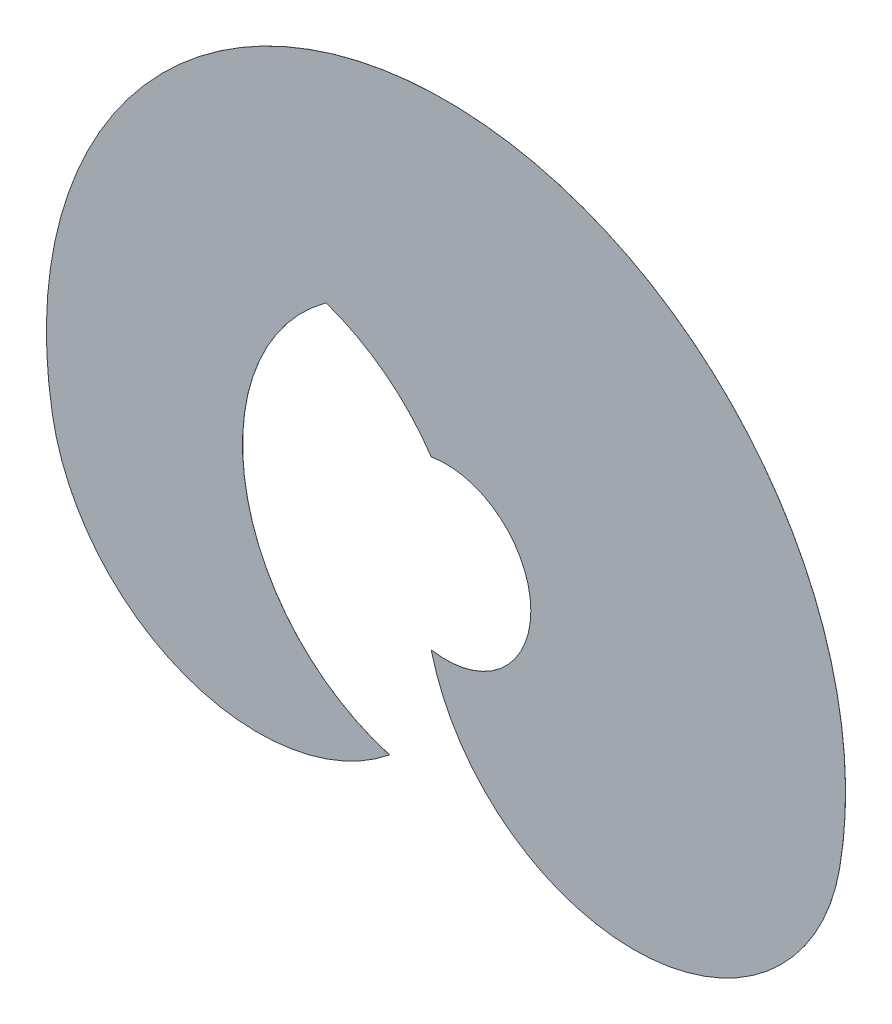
ISO-10303-21;
HEADER;
FILE_DESCRIPTION(('STEP AP214'),'2;1');
FILE_NAME('part.step','',(''),(''),'','','');
FILE_SCHEMA(('AUTOMOTIVE_DESIGN { 1 0 10303 214 1 1 1 1 }'));
ENDSEC;
DATA;
#1=APPLICATION_CONTEXT('core data for automotive mechanical design processes');
#2=APPLICATION_PROTOCOL_DEFINITION('international standard','automotive_design',2000,#1);
#3=PRODUCT_CONTEXT('',#1,'mechanical');
#4=PRODUCT('Part','Part','',(#3));
#5=PRODUCT_RELATED_PRODUCT_CATEGORY('part','',(#4));
#6=PRODUCT_DEFINITION_FORMATION('','',#4);
#7=PRODUCT_DEFINITION_CONTEXT('part definition',#1,'design');
#8=PRODUCT_DEFINITION('design','',#6,#7);
#9=PRODUCT_DEFINITION_SHAPE('','',#8);
#10=(LENGTH_UNIT() NAMED_UNIT(*) SI_UNIT(.MILLI.,.METRE.));
#11=(NAMED_UNIT(*) PLANE_ANGLE_UNIT() SI_UNIT($,.RADIAN.));
#12=(NAMED_UNIT(*) SI_UNIT($,.STERADIAN.) SOLID_ANGLE_UNIT());
#13=UNCERTAINTY_MEASURE_WITH_UNIT(LENGTH_MEASURE(1.E-05),#10,'distance_accuracy_value','');
#14=(GEOMETRIC_REPRESENTATION_CONTEXT(3) GLOBAL_UNCERTAINTY_ASSIGNED_CONTEXT((#13)) GLOBAL_UNIT_ASSIGNED_CONTEXT((#10,
#11,#12)) REPRESENTATION_CONTEXT('',''));
#15=CARTESIAN_POINT('',(0.,0.,0.));
#16=DIRECTION('',(0.,0.,1.));
#17=DIRECTION('',(1.,0.,0.));
#18=AXIS2_PLACEMENT_3D('',#15,#16,#17);
#19=CARTESIAN_POINT('',(250.,607.,0.5));
#20=DIRECTION('',(0.,0.,-1.));
#21=DIRECTION('',(-1.,0.,0.));
#22=AXIS2_PLACEMENT_3D('',#19,#20,#21);
#23=CYLINDRICAL_SURFACE('',#22,1247.77202533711);
#24=CARTESIAN_POINT('',(250.,607.,0.));
#25=DIRECTION('',(0.,0.,-1.));
#26=DIRECTION('',(1.,0.,0.));
#27=AXIS2_PLACEMENT_3D('',#24,#25,#26);
#28=CIRCLE('',#27,1247.77202533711);
#29=CARTESIAN_POINT('',(-96.5199902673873,-591.690503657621,0.));
#30=VERTEX_POINT('',#29);
#31=CARTESIAN_POINT('',(-485.598575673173,1614.88380415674,0.));
#32=VERTEX_POINT('',#31);
#33=EDGE_CURVE('E116',#30,#32,#28,.T.);
#34=ORIENTED_EDGE('',*,*,#33,.T.);
#35=DIRECTION('',(0.,0.,-1.));
#36=VECTOR('',#35,1.);
#37=CARTESIAN_POINT('',(-485.598575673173,1614.88380415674,0.5));
#38=LINE('',#37,#36);
#39=CARTESIAN_POINT('',(-485.598575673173,1614.88380415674,0.5));
#40=VERTEX_POINT('',#39);
#41=EDGE_CURVE('E11',#40,#32,#38,.T.);
#42=ORIENTED_EDGE('',*,*,#41,.F.);
#43=CARTESIAN_POINT('',(250.,607.,0.5));
#44=DIRECTION('',(0.,0.,-1.));
#45=DIRECTION('',(1.,0.,0.));
#46=AXIS2_PLACEMENT_3D('',#43,#44,#45);
#47=CIRCLE('',#46,1247.77202533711);
#48=CARTESIAN_POINT('',(-96.5199902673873,-591.690503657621,0.5));
#49=VERTEX_POINT('',#48);
#50=EDGE_CURVE('E126',#49,#40,#47,.T.);
#51=ORIENTED_EDGE('',*,*,#50,.F.);
#52=DIRECTION('',(0.,0.,-1.));
#53=VECTOR('',#52,1.);
#54=CARTESIAN_POINT('',(-96.5199902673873,-591.690503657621,0.5));
#55=LINE('',#54,#53);
#56=EDGE_CURVE('E112',#49,#30,#55,.T.);
#57=ORIENTED_EDGE('',*,*,#56,.T.);
#58=EDGE_LOOP('',(#34,#42,#51,#57));
#59=FACE_BOUND('',#58,.T.);
#60=ADVANCED_FACE('F32',(#59),#23,.F.);
#61=CARTESIAN_POINT('',(-902.225071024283,403.831632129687,0.5));
#62=DIRECTION('',(0.,0.,-1.));
#63=DIRECTION('',(-1.,0.,0.));
#64=AXIS2_PLACEMENT_3D('',#61,#62,#63);
#65=CYLINDRICAL_SURFACE('',#64,1280.71269221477);
#66=CARTESIAN_POINT('',(-902.225071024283,403.831632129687,0.));
#67=DIRECTION('',(0.,0.,-1.));
#68=DIRECTION('',(1.,0.,0.));
#69=AXIS2_PLACEMENT_3D('',#66,#67,#68);
#70=CIRCLE('',#69,1280.71269221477);
#71=CARTESIAN_POINT('',(159.730627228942,1119.705290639,0.));
#72=VERTEX_POINT('',#71);
#73=EDGE_CURVE('E119',#32,#72,#70,.T.);
#74=ORIENTED_EDGE('',*,*,#73,.T.);
#75=DIRECTION('',(0.,0.,-1.));
#76=VECTOR('',#75,1.);
#77=CARTESIAN_POINT('',(159.730627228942,1119.705290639,0.5));
#78=LINE('',#77,#76);
#79=CARTESIAN_POINT('',(159.730627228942,1119.705290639,0.5));
#80=VERTEX_POINT('',#79);
#81=EDGE_CURVE('E40',#80,#72,#78,.T.);
#82=ORIENTED_EDGE('',*,*,#81,.F.);
#83=CARTESIAN_POINT('',(-902.225071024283,403.831632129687,0.5));
#84=DIRECTION('',(0.,0.,-1.));
#85=DIRECTION('',(1.,0.,0.));
#86=AXIS2_PLACEMENT_3D('',#83,#84,#85);
#87=CIRCLE('',#86,1280.71269221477);
#88=EDGE_CURVE('E85',#40,#80,#87,.T.);
#89=ORIENTED_EDGE('',*,*,#88,.F.);
#90=ORIENTED_EDGE('',*,*,#41,.T.);
#91=EDGE_LOOP('',(#74,#82,#89,#90));
#92=FACE_BOUND('',#91,.T.);
#93=ADVANCED_FACE('F150',(#92),#65,.F.);
#94=CARTESIAN_POINT('',(250.,607.,0.5));
#95=DIRECTION('',(0.,0.,-1.));
#96=DIRECTION('',(-1.,0.,0.));
#97=AXIS2_PLACEMENT_3D('',#94,#95,#96);
#98=CYLINDRICAL_SURFACE('',#97,520.591274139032);
#99=CARTESIAN_POINT('',(250.,607.,0.));
#100=DIRECTION('',(0.,0.,-1.));
#101=DIRECTION('',(1.,0.,0.));
#102=AXIS2_PLACEMENT_3D('',#99,#100,#101);
#103=CIRCLE('',#102,520.591274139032);
#104=CARTESIAN_POINT('',(159.469926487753,94.3406779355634,0.));
#105=VERTEX_POINT('',#104);
#106=EDGE_CURVE('E121',#72,#105,#103,.T.);
#107=ORIENTED_EDGE('',*,*,#106,.T.);
#108=DIRECTION('',(0.,0.,-1.));
#109=VECTOR('',#108,1.);
#110=CARTESIAN_POINT('',(159.469926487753,94.3406779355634,0.5));
#111=LINE('',#110,#109);
#112=CARTESIAN_POINT('',(159.469926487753,94.3406779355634,0.5));
#113=VERTEX_POINT('',#112);
#114=EDGE_CURVE('E107',#113,#105,#111,.T.);
#115=ORIENTED_EDGE('',*,*,#114,.F.);
#116=CARTESIAN_POINT('',(250.,607.,0.5));
#117=DIRECTION('',(0.,0.,-1.));
#118=DIRECTION('',(1.,0.,0.));
#119=AXIS2_PLACEMENT_3D('',#116,#117,#118);
#120=CIRCLE('',#119,520.591274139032);
#121=EDGE_CURVE('E98',#80,#113,#120,.T.);
#122=ORIENTED_EDGE('',*,*,#121,.F.);
#123=ORIENTED_EDGE('',*,*,#81,.T.);
#124=EDGE_LOOP('',(#107,#115,#122,#123));
#125=FACE_BOUND('',#124,.T.);
#126=ADVANCED_FACE('F132',(#125),#98,.F.);
#127=CARTESIAN_POINT('',(1402.22507102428,403.831632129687,0.5));
#128=DIRECTION('',(0.,0.,-1.));
#129=DIRECTION('',(-1.,0.,0.));
#130=AXIS2_PLACEMENT_3D('',#127,#128,#129);
#131=CYLINDRICAL_SURFACE('',#130,1280.71269221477);
#132=CARTESIAN_POINT('',(1402.22507102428,403.831632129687,0.));
#133=DIRECTION('',(0.,0.,1.));
#134=DIRECTION('',(1.,0.,0.));
#135=AXIS2_PLACEMENT_3D('',#132,#133,#134);
#136=CIRCLE('',#135,1280.71269221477);
#137=CARTESIAN_POINT('',(2663.48085969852,181.43820701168,0.));
#138=VERTEX_POINT('',#137);
#139=EDGE_CURVE('E106',#105,#138,#136,.T.);
#140=ORIENTED_EDGE('',*,*,#139,.T.);
#141=DIRECTION('',(0.,0.,-1.));
#142=VECTOR('',#141,1.);
#143=CARTESIAN_POINT('',(2663.48085969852,181.43820701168,0.5));
#144=LINE('',#143,#142);
#145=CARTESIAN_POINT('',(2663.48085969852,181.43820701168,0.5));
#146=VERTEX_POINT('',#145);
#147=EDGE_CURVE('E103',#146,#138,#144,.T.);
#148=ORIENTED_EDGE('',*,*,#147,.F.);
#149=CARTESIAN_POINT('',(1402.22507102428,403.831632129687,0.5));
#150=DIRECTION('',(0.,0.,1.));
#151=DIRECTION('',(1.,0.,0.));
#152=AXIS2_PLACEMENT_3D('',#149,#150,#151);
#153=CIRCLE('',#152,1280.71269221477);
#154=EDGE_CURVE('E92',#113,#146,#153,.T.);
#155=ORIENTED_EDGE('',*,*,#154,.F.);
#156=ORIENTED_EDGE('',*,*,#114,.T.);
#157=EDGE_LOOP('',(#140,#148,#155,#156));
#158=FACE_BOUND('',#157,.T.);
#159=ADVANCED_FACE('F104',(#158),#131,.T.);
#160=CARTESIAN_POINT('',(250.,607.,0.5));
#161=DIRECTION('',(0.,0.,-1.));
#162=DIRECTION('',(-1.,0.,0.));
#163=AXIS2_PLACEMENT_3D('',#160,#161,#162);
#164=CYLINDRICAL_SURFACE('',#163,2450.71269221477);
#165=CARTESIAN_POINT('',(250.,607.,0.));
#166=DIRECTION('',(0.,0.,1.));
#167=DIRECTION('',(1.,0.,0.));
#168=AXIS2_PLACEMENT_3D('',#165,#166,#167);
#169=CIRCLE('',#168,2450.71269221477);
#170=CARTESIAN_POINT('',(-2163.48085969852,181.438207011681,0.));
#171=VERTEX_POINT('',#170);
#172=EDGE_CURVE('E71',#138,#171,#169,.T.);
#173=ORIENTED_EDGE('',*,*,#172,.T.);
#174=DIRECTION('',(0.,0.,-1.));
#175=VECTOR('',#174,1.);
#176=CARTESIAN_POINT('',(-2163.48085969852,181.438207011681,0.5));
#177=LINE('',#176,#175);
#178=CARTESIAN_POINT('',(-2163.48085969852,181.438207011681,0.5));
#179=VERTEX_POINT('',#178);
#180=EDGE_CURVE('E108',#179,#171,#177,.T.);
#181=ORIENTED_EDGE('',*,*,#180,.F.);
#182=CARTESIAN_POINT('',(250.,607.,0.5));
#183=DIRECTION('',(0.,0.,1.));
#184=DIRECTION('',(1.,0.,0.));
#185=AXIS2_PLACEMENT_3D('',#182,#183,#184);
#186=CIRCLE('',#185,2450.71269221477);
#187=EDGE_CURVE('E96',#146,#179,#186,.T.);
#188=ORIENTED_EDGE('',*,*,#187,.F.);
#189=ORIENTED_EDGE('',*,*,#147,.T.);
#190=EDGE_LOOP('',(#173,#181,#188,#189));
#191=FACE_BOUND('',#190,.T.);
#192=ADVANCED_FACE('F110',(#191),#164,.T.);
#193=CARTESIAN_POINT('',(-902.225071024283,403.831632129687,0.5));
#194=DIRECTION('',(0.,0.,-1.));
#195=DIRECTION('',(-1.,0.,0.));
#196=AXIS2_PLACEMENT_3D('',#193,#194,#195);
#197=CYLINDRICAL_SURFACE('',#196,1280.71269221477);
#198=CARTESIAN_POINT('',(-902.225071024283,403.831632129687,0.));
#199=DIRECTION('',(0.,0.,1.));
#200=DIRECTION('',(1.,0.,0.));
#201=AXIS2_PLACEMENT_3D('',#198,#199,#200);
#202=CIRCLE('',#201,1280.71269221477);
#203=EDGE_CURVE('E77',#171,#30,#202,.T.);
#204=ORIENTED_EDGE('',*,*,#203,.T.);
#205=ORIENTED_EDGE('',*,*,#56,.F.);
#206=CARTESIAN_POINT('',(-902.225071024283,403.831632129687,0.5));
#207=DIRECTION('',(0.,0.,1.));
#208=DIRECTION('',(1.,0.,0.));
#209=AXIS2_PLACEMENT_3D('',#206,#207,#208);
#210=CIRCLE('',#209,1280.71269221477);
#211=EDGE_CURVE('E48',#179,#49,#210,.T.);
#212=ORIENTED_EDGE('',*,*,#211,.F.);
#213=ORIENTED_EDGE('',*,*,#180,.T.);
#214=EDGE_LOOP('',(#204,#205,#212,#213));
#215=FACE_BOUND('',#214,.T.);
#216=ADVANCED_FACE('F139',(#215),#197,.T.);
#217=CARTESIAN_POINT('',(-326.112535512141,505.415816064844,0.5));
#218=DIRECTION('',(0.,0.,1.));
#219=DIRECTION('',(1.,0.,0.));
#220=AXIS2_PLACEMENT_3D('',#217,#218,#219);
#221=PLANE('',#220);
#222=ORIENTED_EDGE('',*,*,#50,.T.);
#223=ORIENTED_EDGE('',*,*,#88,.T.);
#224=ORIENTED_EDGE('',*,*,#121,.T.);
#225=ORIENTED_EDGE('',*,*,#154,.T.);
#226=ORIENTED_EDGE('',*,*,#187,.T.);
#227=ORIENTED_EDGE('',*,*,#211,.T.);
#228=EDGE_LOOP('',(#222,#223,#224,#225,#226,#227));
#229=FACE_BOUND('',#228,.T.);
#230=ADVANCED_FACE('F94',(#229),#221,.T.);
#231=CARTESIAN_POINT('',(-326.112535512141,505.415816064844,0.));
#232=DIRECTION('',(0.,0.,1.));
#233=DIRECTION('',(1.,0.,0.));
#234=AXIS2_PLACEMENT_3D('',#231,#232,#233);
#235=PLANE('',#234);
#236=ORIENTED_EDGE('',*,*,#33,.F.);
#237=ORIENTED_EDGE('',*,*,#203,.F.);
#238=ORIENTED_EDGE('',*,*,#172,.F.);
#239=ORIENTED_EDGE('',*,*,#139,.F.);
#240=ORIENTED_EDGE('',*,*,#106,.F.);
#241=ORIENTED_EDGE('',*,*,#73,.F.);
#242=EDGE_LOOP('',(#236,#237,#238,#239,#240,#241));
#243=FACE_BOUND('',#242,.T.);
#244=ADVANCED_FACE('F135',(#243),#235,.F.);
#245=CLOSED_SHELL('',(#60,#93,#126,#159,#192,#216,#230,#244));
#246=MANIFOLD_SOLID_BREP('B2',#245);
#247=ADVANCED_BREP_SHAPE_REPRESENTATION('',(#18,#246),#14);
#248=SHAPE_DEFINITION_REPRESENTATION(#9,#247);
ENDSEC;
END-ISO-10303-21;
